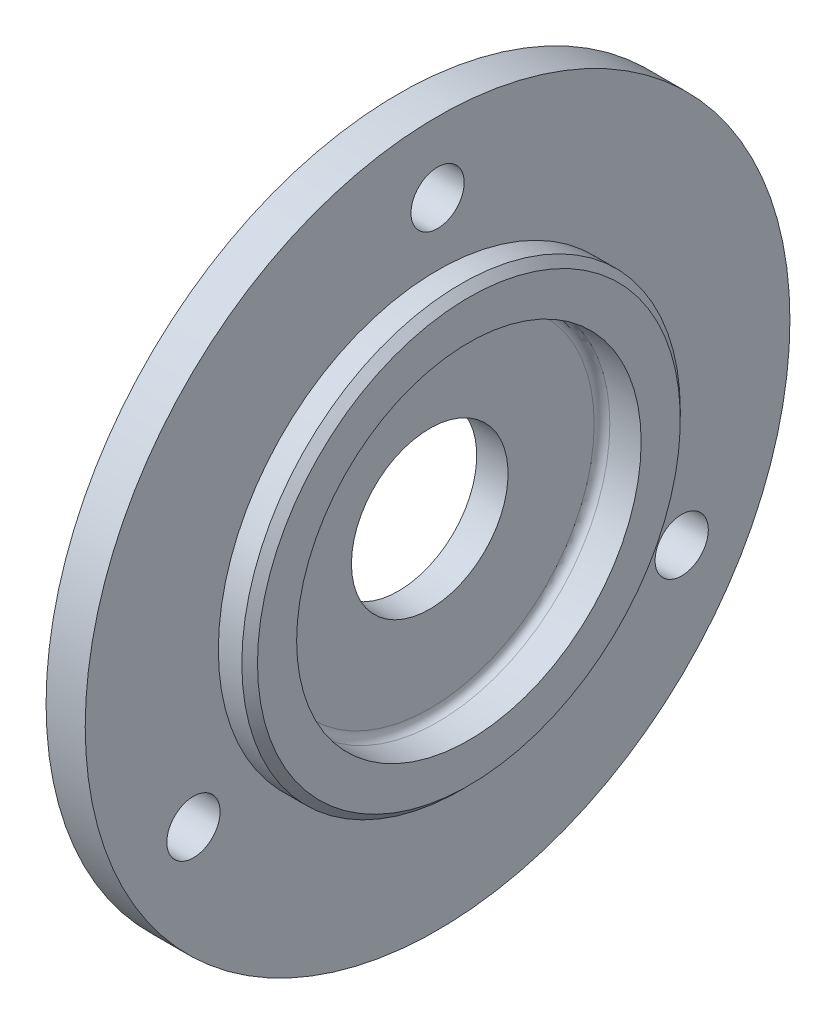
from build123d import *

# Parameters (mm, degrees)
ESQUISSE2_R             = 1.7
ENL_V_MAT_EXTRU_1_DEPTH = 10


with BuildPart() as part:
    # Esquisse1 → R_volution1 (revolve)
    with BuildSketch(Plane.XY, mode=Mode.PRIVATE) as r_volution1_sk:
        with BuildLine():
            Line((-0.5, 5), (-0.5, 10.5))
            ThreePointArc((-0.5, 10.5), (-0.353553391, 10.853553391), (0, 11))
            Line((0, 11), (2, 11))
            Line((2, 11), (2, 13.5))
            Line((2, 13.5), (1.5, 14))
            Line((1.5, 14), (0, 14))
            Line((0, 14), (0, 22.5))
            Line((0, 22.5), (-2.5, 22.5))
            Line((-2.5, 22.5), (-2.5, 5))
            Line((-2.5, 5), (-0.5, 5))
        make_face()
    revolve(r_volution1_sk.sketch.rotate(Axis((-14.777796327, 0, 0), (1, 0, 0)), 90), axis=Axis((-14.777796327, 0, 0), (1, 0, 0)))

    # Esquisse2 → Enl_v. mat.-Extru.1 (cut)
    with BuildSketch(Plane(origin=(0, 0, 0), x_dir=(0, 0, -1), z_dir=(1, 0, 0))):
        with Locations((0, 18)):
            Circle(ESQUISSE2_R)
        with Locations((15.588457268, -9)):
            Circle(ESQUISSE2_R)
        with Locations((-15.588457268, -9)):
            Circle(ESQUISSE2_R)
    extrude(amount=-ENL_V_MAT_EXTRU_1_DEPTH, mode=Mode.SUBTRACT)


solid = part.part
